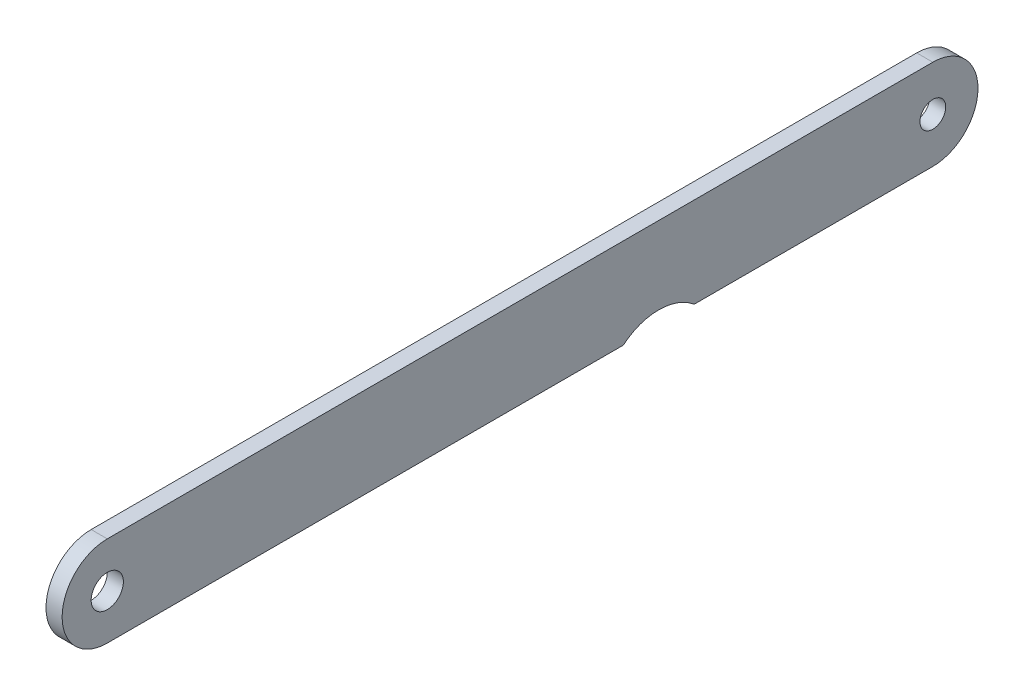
ISO-10303-21;
HEADER;
FILE_DESCRIPTION(('STEP AP214'),'2;1');
FILE_NAME('part.step','',(''),(''),'','','');
FILE_SCHEMA(('AUTOMOTIVE_DESIGN { 1 0 10303 214 1 1 1 1 }'));
ENDSEC;
DATA;
#1=APPLICATION_CONTEXT('core data for automotive mechanical design processes');
#2=APPLICATION_PROTOCOL_DEFINITION('international standard','automotive_design',2000,#1);
#3=PRODUCT_CONTEXT('',#1,'mechanical');
#4=PRODUCT('Part','Part','',(#3));
#5=PRODUCT_RELATED_PRODUCT_CATEGORY('part','',(#4));
#6=PRODUCT_DEFINITION_FORMATION('','',#4);
#7=PRODUCT_DEFINITION_CONTEXT('part definition',#1,'design');
#8=PRODUCT_DEFINITION('design','',#6,#7);
#9=PRODUCT_DEFINITION_SHAPE('','',#8);
#10=(LENGTH_UNIT() NAMED_UNIT(*) SI_UNIT(.MILLI.,.METRE.));
#11=(NAMED_UNIT(*) PLANE_ANGLE_UNIT() SI_UNIT($,.RADIAN.));
#12=(NAMED_UNIT(*) SI_UNIT($,.STERADIAN.) SOLID_ANGLE_UNIT());
#13=UNCERTAINTY_MEASURE_WITH_UNIT(LENGTH_MEASURE(1.E-05),#10,'distance_accuracy_value','');
#14=(GEOMETRIC_REPRESENTATION_CONTEXT(3) GLOBAL_UNCERTAINTY_ASSIGNED_CONTEXT((#13)) GLOBAL_UNIT_ASSIGNED_CONTEXT((#10,
#11,#12)) REPRESENTATION_CONTEXT('',''));
#15=CARTESIAN_POINT('',(0.,0.,0.));
#16=DIRECTION('',(0.,0.,1.));
#17=DIRECTION('',(1.,0.,0.));
#18=AXIS2_PLACEMENT_3D('',#15,#16,#17);
#19=CARTESIAN_POINT('',(2.49999999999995,-14.,1.99840144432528E-12));
#20=DIRECTION('',(0.,1.,0.));
#21=DIRECTION('',(0.,0.,1.));
#22=AXIS2_PLACEMENT_3D('',#19,#20,#21);
#23=PLANE('',#22);
#24=DIRECTION('',(0.,0.,-1.));
#25=VECTOR('',#24,1.);
#26=CARTESIAN_POINT('',(0.,-14.,1.99840144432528E-12));
#27=LINE('',#26,#25);
#28=CARTESIAN_POINT('',(0.,-14.,1.99840144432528E-12));
#29=VERTEX_POINT('',#28);
#30=CARTESIAN_POINT('',(0.,-13.9999999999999,-80.0000000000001));
#31=VERTEX_POINT('',#30);
#32=EDGE_CURVE('E99',#29,#31,#27,.T.);
#33=ORIENTED_EDGE('',*,*,#32,.T.);
#34=DIRECTION('',(1.,0.,0.));
#35=VECTOR('',#34,1.);
#36=CARTESIAN_POINT('',(-0.00100000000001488,-13.9999999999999,-80.0000000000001));
#37=LINE('',#36,#35);
#38=CARTESIAN_POINT('',(2.49999999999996,-13.9999999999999,-80.0000000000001));
#39=VERTEX_POINT('',#38);
#40=EDGE_CURVE('E51',#31,#39,#37,.T.);
#41=ORIENTED_EDGE('',*,*,#40,.T.);
#42=DIRECTION('',(0.,0.,-1.));
#43=VECTOR('',#42,1.);
#44=CARTESIAN_POINT('',(2.49999999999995,-14.,1.99840144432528E-12));
#45=LINE('',#44,#43);
#46=CARTESIAN_POINT('',(2.49999999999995,-14.,1.99840144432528E-12));
#47=VERTEX_POINT('',#46);
#48=EDGE_CURVE('E98',#47,#39,#45,.T.);
#49=ORIENTED_EDGE('',*,*,#48,.F.);
#50=DIRECTION('',(-1.,0.,0.));
#51=VECTOR('',#50,1.);
#52=CARTESIAN_POINT('',(2.49999999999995,-14.,1.99840144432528E-12));
#53=LINE('',#52,#51);
#54=EDGE_CURVE('E11',#47,#29,#53,.T.);
#55=ORIENTED_EDGE('',*,*,#54,.T.);
#56=EDGE_LOOP('',(#33,#41,#49,#55));
#57=FACE_BOUND('',#56,.T.);
#58=ADVANCED_FACE('F35',(#57),#23,.F.);
#59=CARTESIAN_POINT('',(2.49999999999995,-6.99999999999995,1.33226762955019E-12));
#60=DIRECTION('',(-1.,0.,0.));
#61=DIRECTION('',(0.,0.,1.));
#62=AXIS2_PLACEMENT_3D('',#59,#60,#61);
#63=CYLINDRICAL_SURFACE('',#62,7.);
#64=CARTESIAN_POINT('',(0.,-6.99999999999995,1.33226762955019E-12));
#65=DIRECTION('',(1.,0.,0.));
#66=DIRECTION('',(0.,0.,-1.));
#67=AXIS2_PLACEMENT_3D('',#64,#65,#66);
#68=CIRCLE('',#67,7.);
#69=CARTESIAN_POINT('',(0.,0.,0.));
#70=VERTEX_POINT('',#69);
#71=EDGE_CURVE('E138',#70,#29,#68,.T.);
#72=ORIENTED_EDGE('',*,*,#71,.T.);
#73=ORIENTED_EDGE('',*,*,#54,.F.);
#74=CARTESIAN_POINT('',(2.49999999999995,-6.99999999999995,1.33226762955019E-12));
#75=DIRECTION('',(1.,0.,0.));
#76=DIRECTION('',(0.,0.,-1.));
#77=AXIS2_PLACEMENT_3D('',#74,#75,#76);
#78=CIRCLE('',#77,7.);
#79=CARTESIAN_POINT('',(2.50000000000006,0.,0.));
#80=VERTEX_POINT('',#79);
#81=EDGE_CURVE('E103',#80,#47,#78,.T.);
#82=ORIENTED_EDGE('',*,*,#81,.F.);
#83=DIRECTION('',(-1.,0.,0.));
#84=VECTOR('',#83,1.);
#85=CARTESIAN_POINT('',(2.50000000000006,0.,0.));
#86=LINE('',#85,#84);
#87=EDGE_CURVE('E113',#80,#70,#86,.T.);
#88=ORIENTED_EDGE('',*,*,#87,.T.);
#89=EDGE_LOOP('',(#72,#73,#82,#88));
#90=FACE_BOUND('',#89,.T.);
#91=ADVANCED_FACE('F37',(#90),#63,.T.);
#92=CARTESIAN_POINT('',(2.49999999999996,-14.0000000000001,-91.0000000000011));
#93=VERTEX_POINT('',#92);
#94=CARTESIAN_POINT('',(2.49999999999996,-14.,-127.999999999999));
#95=VERTEX_POINT('',#94);
#96=EDGE_CURVE('E106',#93,#95,#45,.T.);
#97=ORIENTED_EDGE('',*,*,#96,.F.);
#98=DIRECTION('',(1.,0.,0.));
#99=VECTOR('',#98,1.);
#100=CARTESIAN_POINT('',(-0.00100000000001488,-14.0000000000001,-91.0000000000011));
#101=LINE('',#100,#99);
#102=CARTESIAN_POINT('',(0.,-14.0000000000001,-91.0000000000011));
#103=VERTEX_POINT('',#102);
#104=EDGE_CURVE('E91',#103,#93,#101,.T.);
#105=ORIENTED_EDGE('',*,*,#104,.F.);
#106=CARTESIAN_POINT('',(0.,-14.,-127.999999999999));
#107=VERTEX_POINT('',#106);
#108=EDGE_CURVE('E132',#103,#107,#27,.T.);
#109=ORIENTED_EDGE('',*,*,#108,.T.);
#110=DIRECTION('',(-1.,0.,0.));
#111=VECTOR('',#110,1.);
#112=CARTESIAN_POINT('',(2.49999999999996,-14.,-127.999999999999));
#113=LINE('',#112,#111);
#114=EDGE_CURVE('E44',#95,#107,#113,.T.);
#115=ORIENTED_EDGE('',*,*,#114,.F.);
#116=EDGE_LOOP('',(#97,#105,#109,#115));
#117=FACE_BOUND('',#116,.T.);
#118=ADVANCED_FACE('F168',(#117),#23,.F.);
#119=CARTESIAN_POINT('',(2.49999999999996,-7.00000000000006,-128.));
#120=DIRECTION('',(-1.,0.,0.));
#121=DIRECTION('',(0.,0.,1.));
#122=AXIS2_PLACEMENT_3D('',#119,#120,#121);
#123=CYLINDRICAL_SURFACE('',#122,7.);
#124=CARTESIAN_POINT('',(0.,-7.00000000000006,-128.));
#125=DIRECTION('',(1.,0.,0.));
#126=DIRECTION('',(0.,0.,-1.));
#127=AXIS2_PLACEMENT_3D('',#124,#125,#126);
#128=CIRCLE('',#127,7.);
#129=CARTESIAN_POINT('',(0.,-1.11022302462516E-13,-128.));
#130=VERTEX_POINT('',#129);
#131=EDGE_CURVE('E126',#107,#130,#128,.T.);
#132=ORIENTED_EDGE('',*,*,#131,.T.);
#133=DIRECTION('',(-1.,0.,0.));
#134=VECTOR('',#133,1.);
#135=CARTESIAN_POINT('',(2.50000000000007,-1.11022302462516E-13,-128.));
#136=LINE('',#135,#134);
#137=CARTESIAN_POINT('',(2.50000000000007,-1.11022302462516E-13,-128.));
#138=VERTEX_POINT('',#137);
#139=EDGE_CURVE('E116',#138,#130,#136,.T.);
#140=ORIENTED_EDGE('',*,*,#139,.F.);
#141=CARTESIAN_POINT('',(2.49999999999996,-7.00000000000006,-128.));
#142=DIRECTION('',(1.,0.,0.));
#143=DIRECTION('',(0.,0.,-1.));
#144=AXIS2_PLACEMENT_3D('',#141,#142,#143);
#145=CIRCLE('',#144,7.);
#146=EDGE_CURVE('E105',#95,#138,#145,.T.);
#147=ORIENTED_EDGE('',*,*,#146,.F.);
#148=ORIENTED_EDGE('',*,*,#114,.T.);
#149=EDGE_LOOP('',(#132,#140,#147,#148));
#150=FACE_BOUND('',#149,.T.);
#151=ADVANCED_FACE('F124',(#150),#123,.T.);
#152=CARTESIAN_POINT('',(2.50000000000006,0.,0.));
#153=DIRECTION('',(0.,-1.,0.));
#154=DIRECTION('',(0.,0.,-1.));
#155=AXIS2_PLACEMENT_3D('',#152,#153,#154);
#156=PLANE('',#155);
#157=DIRECTION('',(0.,0.,1.));
#158=VECTOR('',#157,1.);
#159=CARTESIAN_POINT('',(0.,0.,0.));
#160=LINE('',#159,#158);
#161=EDGE_CURVE('E134',#130,#70,#160,.T.);
#162=ORIENTED_EDGE('',*,*,#161,.T.);
#163=ORIENTED_EDGE('',*,*,#87,.F.);
#164=DIRECTION('',(0.,0.,1.));
#165=VECTOR('',#164,1.);
#166=CARTESIAN_POINT('',(2.50000000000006,0.,0.));
#167=LINE('',#166,#165);
#168=EDGE_CURVE('E59',#138,#80,#167,.T.);
#169=ORIENTED_EDGE('',*,*,#168,.F.);
#170=ORIENTED_EDGE('',*,*,#139,.T.);
#171=EDGE_LOOP('',(#162,#163,#169,#170));
#172=FACE_BOUND('',#171,.T.);
#173=ADVANCED_FACE('F178',(#172),#156,.F.);
#174=CARTESIAN_POINT('',(2.49999999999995,-6.99999999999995,1.33226762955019E-12));
#175=DIRECTION('',(1.,0.,0.));
#176=DIRECTION('',(0.,0.,-1.));
#177=AXIS2_PLACEMENT_3D('',#174,#175,#176);
#178=PLANE('',#177);
#179=CARTESIAN_POINT('',(2.49999999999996,-7.00000000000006,-128.));
#180=DIRECTION('',(1.,0.,0.));
#181=DIRECTION('',(0.,0.,-1.));
#182=AXIS2_PLACEMENT_3D('',#179,#180,#181);
#183=CIRCLE('',#182,2.);
#184=CARTESIAN_POINT('',(2.49999999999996,-7.00000000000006,-130.));
#185=VERTEX_POINT('',#184);
#186=EDGE_CURVE('E149',#185,#185,#183,.T.);
#187=ORIENTED_EDGE('',*,*,#186,.F.);
#188=EDGE_LOOP('',(#187));
#189=FACE_BOUND('',#188,.T.);
#190=CARTESIAN_POINT('',(2.49999999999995,-6.99999999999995,1.33226762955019E-12));
#191=DIRECTION('',(1.,0.,0.));
#192=DIRECTION('',(0.,0.,-1.));
#193=AXIS2_PLACEMENT_3D('',#190,#191,#192);
#194=CIRCLE('',#193,2.49999999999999);
#195=CARTESIAN_POINT('',(2.49999999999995,-6.99999999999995,-2.49999999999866));
#196=VERTEX_POINT('',#195);
#197=EDGE_CURVE('E146',#196,#196,#194,.T.);
#198=ORIENTED_EDGE('',*,*,#197,.F.);
#199=EDGE_LOOP('',(#198));
#200=FACE_BOUND('',#199,.T.);
#201=CARTESIAN_POINT('',(2.49999999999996,-20.5625,-85.4999999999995));
#202=DIRECTION('',(1.,0.,0.));
#203=DIRECTION('',(0.,0.,-1.));
#204=AXIS2_PLACEMENT_3D('',#201,#202,#203);
#205=CIRCLE('',#204,8.5625);
#206=EDGE_CURVE('E88',#93,#39,#205,.T.);
#207=ORIENTED_EDGE('',*,*,#206,.F.);
#208=ORIENTED_EDGE('',*,*,#96,.T.);
#209=ORIENTED_EDGE('',*,*,#146,.T.);
#210=ORIENTED_EDGE('',*,*,#168,.T.);
#211=ORIENTED_EDGE('',*,*,#81,.T.);
#212=ORIENTED_EDGE('',*,*,#48,.T.);
#213=EDGE_LOOP('',(#207,#208,#209,#210,#211,#212));
#214=FACE_BOUND('',#213,.T.);
#215=ADVANCED_FACE('F101',(#189,#200,#214),#178,.T.);
#216=CARTESIAN_POINT('',(0.,-6.99999999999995,1.33226762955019E-12));
#217=DIRECTION('',(1.,0.,0.));
#218=DIRECTION('',(0.,0.,-1.));
#219=AXIS2_PLACEMENT_3D('',#216,#217,#218);
#220=PLANE('',#219);
#221=CARTESIAN_POINT('',(0.,-7.00000000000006,-128.));
#222=DIRECTION('',(1.,0.,0.));
#223=DIRECTION('',(0.,0.,-1.));
#224=AXIS2_PLACEMENT_3D('',#221,#222,#223);
#225=CIRCLE('',#224,2.);
#226=CARTESIAN_POINT('',(0.,-7.00000000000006,-130.));
#227=VERTEX_POINT('',#226);
#228=EDGE_CURVE('E39',#227,#227,#225,.T.);
#229=ORIENTED_EDGE('',*,*,#228,.T.);
#230=EDGE_LOOP('',(#229));
#231=FACE_BOUND('',#230,.T.);
#232=CARTESIAN_POINT('',(0.,-6.99999999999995,1.33226762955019E-12));
#233=DIRECTION('',(1.,0.,0.));
#234=DIRECTION('',(0.,0.,-1.));
#235=AXIS2_PLACEMENT_3D('',#232,#233,#234);
#236=CIRCLE('',#235,2.49999999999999);
#237=CARTESIAN_POINT('',(0.,-6.99999999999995,-2.49999999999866));
#238=VERTEX_POINT('',#237);
#239=EDGE_CURVE('E143',#238,#238,#236,.T.);
#240=ORIENTED_EDGE('',*,*,#239,.T.);
#241=EDGE_LOOP('',(#240));
#242=FACE_BOUND('',#241,.T.);
#243=ORIENTED_EDGE('',*,*,#108,.F.);
#244=CARTESIAN_POINT('',(0.,-20.5625,-85.4999999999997));
#245=DIRECTION('',(1.,0.,0.));
#246=DIRECTION('',(0.,0.,-1.));
#247=AXIS2_PLACEMENT_3D('',#244,#245,#246);
#248=CIRCLE('',#247,8.5625);
#249=EDGE_CURVE('E94',#31,#103,#248,.F.);
#250=ORIENTED_EDGE('',*,*,#249,.F.);
#251=ORIENTED_EDGE('',*,*,#32,.F.);
#252=ORIENTED_EDGE('',*,*,#71,.F.);
#253=ORIENTED_EDGE('',*,*,#161,.F.);
#254=ORIENTED_EDGE('',*,*,#131,.F.);
#255=EDGE_LOOP('',(#243,#250,#251,#252,#253,#254));
#256=FACE_BOUND('',#255,.T.);
#257=ADVANCED_FACE('F131',(#231,#242,#256),#220,.F.);
#258=CARTESIAN_POINT('',(-0.00100000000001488,-20.5625,-85.4999999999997));
#259=DIRECTION('',(1.,0.,0.));
#260=DIRECTION('',(0.,0.,-1.));
#261=AXIS2_PLACEMENT_3D('',#258,#259,#260);
#262=CYLINDRICAL_SURFACE('',#261,8.5625);
#263=ORIENTED_EDGE('',*,*,#249,.T.);
#264=ORIENTED_EDGE('',*,*,#104,.T.);
#265=ORIENTED_EDGE('',*,*,#206,.T.);
#266=ORIENTED_EDGE('',*,*,#40,.F.);
#267=EDGE_LOOP('',(#263,#264,#265,#266));
#268=FACE_BOUND('',#267,.T.);
#269=ADVANCED_FACE('F89',(#268),#262,.F.);
#270=CARTESIAN_POINT('',(2.49999999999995,-6.99999999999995,1.33226762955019E-12));
#271=DIRECTION('',(1.,0.,0.));
#272=DIRECTION('',(0.,0.,-1.));
#273=AXIS2_PLACEMENT_3D('',#270,#271,#272);
#274=CYLINDRICAL_SURFACE('',#273,2.49999999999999);
#275=ORIENTED_EDGE('',*,*,#239,.F.);
#276=EDGE_LOOP('',(#275));
#277=FACE_BOUND('',#276,.T.);
#278=ORIENTED_EDGE('',*,*,#197,.T.);
#279=EDGE_LOOP('',(#278));
#280=FACE_BOUND('',#279,.T.);
#281=ADVANCED_FACE('F160',(#277,#280),#274,.F.);
#282=CARTESIAN_POINT('',(2.49999999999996,-7.00000000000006,-128.));
#283=DIRECTION('',(1.,0.,0.));
#284=DIRECTION('',(0.,0.,-1.));
#285=AXIS2_PLACEMENT_3D('',#282,#283,#284);
#286=CYLINDRICAL_SURFACE('',#285,2.);
#287=ORIENTED_EDGE('',*,*,#186,.T.);
#288=EDGE_LOOP('',(#287));
#289=FACE_BOUND('',#288,.T.);
#290=ORIENTED_EDGE('',*,*,#228,.F.);
#291=EDGE_LOOP('',(#290));
#292=FACE_BOUND('',#291,.T.);
#293=ADVANCED_FACE('F158',(#289,#292),#286,.F.);
#294=CLOSED_SHELL('',(#58,#91,#118,#151,#173,#215,#257,#269,#281,#293));
#295=MANIFOLD_SOLID_BREP('B2',#294);
#296=ADVANCED_BREP_SHAPE_REPRESENTATION('',(#18,#295),#14);
#297=SHAPE_DEFINITION_REPRESENTATION(#9,#296);
ENDSEC;
END-ISO-10303-21;
